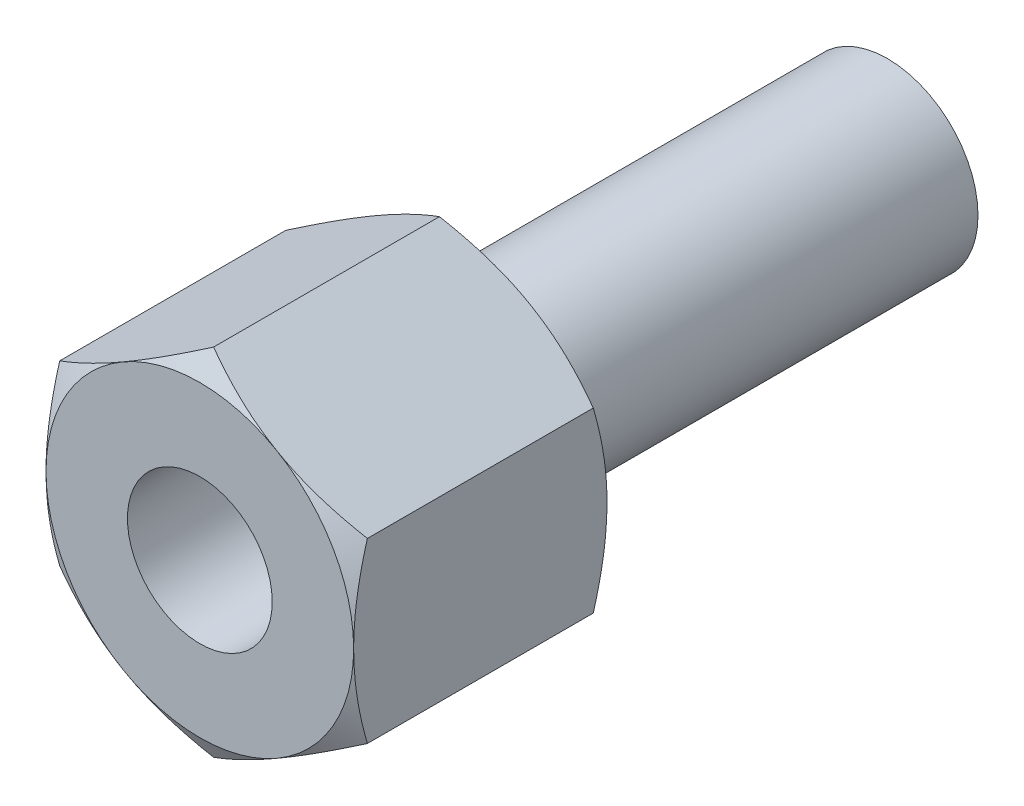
ISO-10303-21;
HEADER;
FILE_DESCRIPTION(('STEP AP214'),'2;1');
FILE_NAME('part.step','',(''),(''),'','','');
FILE_SCHEMA(('AUTOMOTIVE_DESIGN { 1 0 10303 214 1 1 1 1 }'));
ENDSEC;
DATA;
#1=APPLICATION_CONTEXT('core data for automotive mechanical design processes');
#2=APPLICATION_PROTOCOL_DEFINITION('international standard','automotive_design',2000,#1);
#3=PRODUCT_CONTEXT('',#1,'mechanical');
#4=PRODUCT('Part','Part','',(#3));
#5=PRODUCT_RELATED_PRODUCT_CATEGORY('part','',(#4));
#6=PRODUCT_DEFINITION_FORMATION('','',#4);
#7=PRODUCT_DEFINITION_CONTEXT('part definition',#1,'design');
#8=PRODUCT_DEFINITION('design','',#6,#7);
#9=PRODUCT_DEFINITION_SHAPE('','',#8);
#10=(LENGTH_UNIT() NAMED_UNIT(*) SI_UNIT(.MILLI.,.METRE.));
#11=(NAMED_UNIT(*) PLANE_ANGLE_UNIT() SI_UNIT($,.RADIAN.));
#12=(NAMED_UNIT(*) SI_UNIT($,.STERADIAN.) SOLID_ANGLE_UNIT());
#13=UNCERTAINTY_MEASURE_WITH_UNIT(LENGTH_MEASURE(1.E-05),#10,'distance_accuracy_value','');
#14=(GEOMETRIC_REPRESENTATION_CONTEXT(3) GLOBAL_UNCERTAINTY_ASSIGNED_CONTEXT((#13)) GLOBAL_UNIT_ASSIGNED_CONTEXT((#10,
#11,#12)) REPRESENTATION_CONTEXT('',''));
#15=CARTESIAN_POINT('',(0.,0.,0.));
#16=DIRECTION('',(0.,0.,1.));
#17=DIRECTION('',(1.,0.,0.));
#18=AXIS2_PLACEMENT_3D('',#15,#16,#17);
#19=CARTESIAN_POINT('',(-8.5,14.7224318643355,14.));
#20=DIRECTION('',(0.,0.,1.));
#21=DIRECTION('',(1.,0.,0.));
#22=AXIS2_PLACEMENT_3D('',#19,#20,#21);
#23=PLANE('',#22);
#24=CARTESIAN_POINT('',(0.,0.,14.));
#25=DIRECTION('',(0.,0.,1.));
#26=DIRECTION('',(1.,0.,0.));
#27=AXIS2_PLACEMENT_3D('',#24,#25,#26);
#28=CIRCLE('',#27,8.5);
#29=CARTESIAN_POINT('',(8.5,0.,14.));
#30=VERTEX_POINT('',#29);
#31=CARTESIAN_POINT('',(4.25,-7.36121593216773,14.));
#32=VERTEX_POINT('',#31);
#33=EDGE_CURVE('E311',#30,#32,#28,.F.);
#34=ORIENTED_EDGE('',*,*,#33,.F.);
#35=CARTESIAN_POINT('',(4.25,7.36121593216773,14.));
#36=VERTEX_POINT('',#35);
#37=EDGE_CURVE('E308',#36,#30,#28,.F.);
#38=ORIENTED_EDGE('',*,*,#37,.F.);
#39=CARTESIAN_POINT('',(-4.25,7.36121593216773,14.));
#40=VERTEX_POINT('',#39);
#41=EDGE_CURVE('E310',#40,#36,#28,.F.);
#42=ORIENTED_EDGE('',*,*,#41,.F.);
#43=CARTESIAN_POINT('',(0.,0.,14.));
#44=DIRECTION('',(0.,0.,-1.));
#45=DIRECTION('',(-1.,0.,0.));
#46=AXIS2_PLACEMENT_3D('',#43,#44,#45);
#47=CIRCLE('',#46,8.5);
#48=CARTESIAN_POINT('',(-8.5,0.,14.));
#49=VERTEX_POINT('',#48);
#50=EDGE_CURVE('E331',#49,#40,#47,.T.);
#51=ORIENTED_EDGE('',*,*,#50,.F.);
#52=CARTESIAN_POINT('',(-4.25,-7.36121593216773,14.));
#53=VERTEX_POINT('',#52);
#54=EDGE_CURVE('E314',#53,#49,#28,.F.);
#55=ORIENTED_EDGE('',*,*,#54,.F.);
#56=EDGE_CURVE('E316',#32,#53,#28,.F.);
#57=ORIENTED_EDGE('',*,*,#56,.F.);
#58=EDGE_LOOP('',(#34,#38,#42,#51,#55,#57));
#59=FACE_BOUND('',#58,.T.);
#60=CARTESIAN_POINT('',(0.,0.,14.));
#61=DIRECTION('',(0.,0.,1.));
#62=DIRECTION('',(1.,0.,0.));
#63=AXIS2_PLACEMENT_3D('',#60,#61,#62);
#64=CIRCLE('',#63,4.);
#65=CARTESIAN_POINT('',(4.,0.,14.));
#66=VERTEX_POINT('',#65);
#67=EDGE_CURVE('E287',#66,#66,#64,.T.);
#68=ORIENTED_EDGE('',*,*,#67,.F.);
#69=EDGE_LOOP('',(#68));
#70=FACE_BOUND('',#69,.T.);
#71=ADVANCED_FACE('F14',(#59,#70),#23,.T.);
#72=CARTESIAN_POINT('',(3.4,0.,6.));
#73=DIRECTION('',(0.,0.,-1.));
#74=DIRECTION('',(-1.,0.,0.));
#75=AXIS2_PLACEMENT_3D('',#72,#73,#74);
#76=PLANE('',#75);
#77=CARTESIAN_POINT('',(0.,0.,6.));
#78=DIRECTION('',(0.,0.,1.));
#79=DIRECTION('',(1.,0.,0.));
#80=AXIS2_PLACEMENT_3D('',#77,#78,#79);
#81=CIRCLE('',#80,4.);
#82=CARTESIAN_POINT('',(4.,0.,6.));
#83=VERTEX_POINT('',#82);
#84=EDGE_CURVE('E284',#83,#83,#81,.T.);
#85=ORIENTED_EDGE('',*,*,#84,.T.);
#86=EDGE_LOOP('',(#85));
#87=FACE_BOUND('',#86,.T.);
#88=ADVANCED_FACE('F250',(#87),#76,.F.);
#89=CARTESIAN_POINT('',(0.,0.,14.));
#90=DIRECTION('',(0.,0.,1.));
#91=DIRECTION('',(1.,0.,0.));
#92=AXIS2_PLACEMENT_3D('',#89,#90,#91);
#93=CYLINDRICAL_SURFACE('',#92,4.);
#94=ORIENTED_EDGE('',*,*,#84,.F.);
#95=EDGE_LOOP('',(#94));
#96=FACE_BOUND('',#95,.T.);
#97=ORIENTED_EDGE('',*,*,#67,.T.);
#98=EDGE_LOOP('',(#97));
#99=FACE_BOUND('',#98,.T.);
#100=ADVANCED_FACE('F256',(#96,#99),#93,.F.);
#101=CARTESIAN_POINT('',(0.,0.,14.));
#102=DIRECTION('',(0.,0.,-1.));
#103=DIRECTION('',(-1.,0.,0.));
#104=AXIS2_PLACEMENT_3D('',#101,#102,#103);
#105=CONICAL_SURFACE('',#104,8.5,1.0471975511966);
#106=ORIENTED_EDGE('',*,*,#37,.T.);
#107=CARTESIAN_POINT('',(8.5,-13.1838015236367,9.85093963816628));
#108=CARTESIAN_POINT('',(8.5,-12.8125439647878,10.0310397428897));
#109=CARTESIAN_POINT('',(8.5,-12.4404343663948,10.2094135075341));
#110=CARTESIAN_POINT('',(8.5,-11.6940579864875,10.5617374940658));
#111=CARTESIAN_POINT('',(8.5,-11.3197908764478,10.7356870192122));
#112=CARTESIAN_POINT('',(8.5,-10.5667187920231,11.0790664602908));
#113=CARTESIAN_POINT('',(8.5,-10.1879002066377,11.2484666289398));
#114=CARTESIAN_POINT('',(8.5,-9.42725080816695,11.5803371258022));
#115=CARTESIAN_POINT('',(8.5,-9.04542013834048,11.7428077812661));
#116=CARTESIAN_POINT('',(8.5,-8.26579118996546,12.0640781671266));
#117=CARTESIAN_POINT('',(8.5,-7.86787433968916,12.222591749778));
#118=CARTESIAN_POINT('',(8.5,-7.06738682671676,12.5276262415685));
#119=CARTESIAN_POINT('',(8.5,-6.66481564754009,12.6741458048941));
#120=CARTESIAN_POINT('',(8.5,-5.85512714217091,12.9513465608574));
#121=CARTESIAN_POINT('',(8.5,-5.44802090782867,13.0820598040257));
#122=CARTESIAN_POINT('',(8.5,-4.62798318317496,13.3234563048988));
#123=CARTESIAN_POINT('',(8.5,-4.21505357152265,13.43414586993));
#124=CARTESIAN_POINT('',(8.5,-3.38536736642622,13.6295856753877));
#125=CARTESIAN_POINT('',(8.5,-2.96864496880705,13.7144771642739));
#126=CARTESIAN_POINT('',(8.5,-2.33976505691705,13.8187936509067));
#127=CARTESIAN_POINT('',(8.5,-2.12949022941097,13.8497304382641));
#128=CARTESIAN_POINT('',(8.5,-1.70789480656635,13.903323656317));
#129=CARTESIAN_POINT('',(8.5,-1.4965743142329,13.9259808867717));
#130=CARTESIAN_POINT('',(8.5,-1.07593171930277,13.9622793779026));
#131=CARTESIAN_POINT('',(8.5,-0.866619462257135,13.9760342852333));
#132=CARTESIAN_POINT('',(8.5,-0.447600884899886,13.9946804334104));
#133=CARTESIAN_POINT('',(8.5,-0.237894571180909,13.9995718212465));
#134=CARTESIAN_POINT('',(8.5,0.181537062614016,14.000374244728));
#135=CARTESIAN_POINT('',(8.5,0.391262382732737,13.9962852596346));
#136=CARTESIAN_POINT('',(8.5,0.810354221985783,13.9792268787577));
#137=CARTESIAN_POINT('',(8.5,1.0197207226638,13.9662570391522));
#138=CARTESIAN_POINT('',(8.5,1.52285135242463,13.9246924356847));
#139=CARTESIAN_POINT('',(8.5,1.8162749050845,13.8918862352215));
#140=CARTESIAN_POINT('',(8.5,2.40093145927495,13.8106200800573));
#141=CARTESIAN_POINT('',(8.5,2.69216415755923,13.7621579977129));
#142=CARTESIAN_POINT('',(8.5,3.56225119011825,13.5958587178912));
#143=CARTESIAN_POINT('',(8.5,4.13716638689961,13.4571391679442));
#144=CARTESIAN_POINT('',(8.5,4.99679192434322,13.2167488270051));
#145=CARTESIAN_POINT('',(8.5,5.28596559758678,13.1301219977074));
#146=CARTESIAN_POINT('',(8.5,5.86150418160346,12.947909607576));
#147=CARTESIAN_POINT('',(8.5,6.14786907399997,12.8523239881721));
#148=CARTESIAN_POINT('',(8.5,6.7178806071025,12.6537243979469));
#149=CARTESIAN_POINT('',(8.5,7.00152811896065,12.5507129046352));
#150=CARTESIAN_POINT('',(8.5,7.56647596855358,12.3384697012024));
#151=CARTESIAN_POINT('',(8.5,7.84777633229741,12.2292380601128));
#152=CARTESIAN_POINT('',(8.5,8.50541058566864,11.9668356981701));
#153=CARTESIAN_POINT('',(8.5,8.8809007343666,11.8115544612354));
#154=CARTESIAN_POINT('',(8.5,9.62872987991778,11.493559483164));
#155=CARTESIAN_POINT('',(8.5,10.0010686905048,11.3308453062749));
#156=CARTESIAN_POINT('',(8.5,10.7431731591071,10.9994548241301));
#157=CARTESIAN_POINT('',(8.5,11.112938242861,10.8307772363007));
#158=CARTESIAN_POINT('',(8.5,11.8502384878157,10.4886477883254));
#159=CARTESIAN_POINT('',(8.5,12.2177736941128,10.3151960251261));
#160=CARTESIAN_POINT('',(8.5,12.951370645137,9.96421534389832));
#161=CARTESIAN_POINT('',(8.5,13.3174304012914,9.7866822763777));
#162=CARTESIAN_POINT('',(8.5,14.047975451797,9.42840278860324));
#163=CARTESIAN_POINT('',(8.5,14.4124607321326,9.24765633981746));
#164=CARTESIAN_POINT('',(8.5,15.5038325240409,8.7014894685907));
#165=CARTESIAN_POINT('',(8.5,16.2287303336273,8.33209552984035));
#166=CARTESIAN_POINT('',(8.5,17.6149585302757,7.61664110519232));
#167=CARTESIAN_POINT('',(8.5,18.2765956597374,7.27117230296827));
#168=CARTESIAN_POINT('',(8.5,19.5973912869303,6.5754775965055));
#169=CARTESIAN_POINT('',(8.49999999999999,20.2565496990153,6.22525152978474));
#170=CARTESIAN_POINT('',(8.49999999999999,21.5713156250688,5.52203266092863));
#171=CARTESIAN_POINT('',(8.49999999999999,22.2269278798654,5.16904870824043));
#172=CARTESIAN_POINT('',(8.49999999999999,23.5365636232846,4.46022892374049));
#173=CARTESIAN_POINT('',(8.5,24.1905871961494,4.1043932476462));
#174=CARTESIAN_POINT('',(8.5,24.8440243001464,3.74749110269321));
#175=B_SPLINE_CURVE_WITH_KNOTS('',3,(#107,#108,#109,#110,#111,#112,#113,#114,#115,#116,#117,
#118,#119,#120,#121,#122,#123,#124,#125,#126,#127,#128,#129,#130,#131,#132,#133,#134,#135,#136,
#137,#138,#139,#140,#141,#142,#143,#144,#145,#146,#147,#148,#149,#150,#151,#152,#153,#154,#155,
#156,#157,#158,#159,#160,#161,#162,#163,#164,#165,#166,#167,#168,#169,#170,#171,#172,#173,#174),
.UNSPECIFIED.,.F.,.F.,(4,2,2,2,2,2,2,2,2,2,2,2,2,2,2,2,2,2,2,2,2,2,2,2,2,2,2,2,2,2,2,2,2,4),(0.,
1.23792220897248,2.47603817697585,3.72089197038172,4.96568690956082,6.25051912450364,
7.53549530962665,8.81782062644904,10.0997413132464,11.3745112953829,12.0119892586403,
12.649405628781,13.2785153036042,13.9076145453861,14.536715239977,15.1658473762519,
16.0511025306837,16.9364780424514,18.708213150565,19.6137486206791,20.5192900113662,
21.424530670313,22.3297612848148,23.5486479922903,24.7676062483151,25.9868282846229,
27.2060255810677,28.4265226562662,29.6470305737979,32.087728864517,34.3269070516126,
36.5661619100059,38.7999462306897,41.0336093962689),.UNSPECIFIED.);
#176=CARTESIAN_POINT('',(8.5,4.90747728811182,13.2408106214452));
#177=VERTEX_POINT('',#176);
#178=EDGE_CURVE('E343',#177,#30,#175,.F.);
#179=ORIENTED_EDGE('',*,*,#178,.F.);
#180=CARTESIAN_POINT('',(-0.000200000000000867,9.81507004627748,13.240743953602));
#181=CARTESIAN_POINT('',(0.18663922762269,9.70719836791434,13.3030138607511));
#182=CARTESIAN_POINT('',(0.374175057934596,9.59892450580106,13.3624577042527));
#183=CARTESIAN_POINT('',(0.750769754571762,9.3814974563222,13.4749148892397));
#184=CARTESIAN_POINT('',(0.939829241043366,9.27234391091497,13.5279254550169));
#185=CARTESIAN_POINT('',(1.5100347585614,8.94313560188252,13.6762666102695));
#186=CARTESIAN_POINT('',(1.89343164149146,8.72178130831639,13.7606410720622));
#187=CARTESIAN_POINT('',(2.46717766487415,8.39052888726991,13.8595799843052));
#188=CARTESIAN_POINT('',(2.65581276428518,8.28162036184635,13.8877648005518));
#189=CARTESIAN_POINT('',(3.0339360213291,8.06331079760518,13.9350259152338));
#190=CARTESIAN_POINT('',(3.22342410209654,7.95390980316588,13.954103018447));
#191=CARTESIAN_POINT('',(3.60272652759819,7.73491944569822,13.9826652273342));
#192=CARTESIAN_POINT('',(3.79254025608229,7.62533043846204,13.9921612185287));
#193=CARTESIAN_POINT('',(4.17234305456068,7.40605119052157,14.0013576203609));
#194=CARTESIAN_POINT('',(4.36233211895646,7.29636095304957,14.0010583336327));
#195=CARTESIAN_POINT('',(4.71752301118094,7.09129139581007,13.9913455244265));
#196=CARTESIAN_POINT('',(4.88274990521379,6.99589760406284,13.9831168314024));
#197=CARTESIAN_POINT('',(5.21281671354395,6.80533344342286,13.9594107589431));
#198=CARTESIAN_POINT('',(5.37765660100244,6.71016309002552,13.9439328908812));
#199=CARTESIAN_POINT('',(5.87153810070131,6.42502047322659,13.8869913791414));
#200=CARTESIAN_POINT('',(6.19970550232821,6.23555293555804,13.8350269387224));
#201=CARTESIAN_POINT('',(6.85952142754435,5.8546080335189,13.7051150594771));
#202=CARTESIAN_POINT('',(7.19108574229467,5.66317928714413,13.626616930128));
#203=CARTESIAN_POINT('',(7.84926989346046,5.28317649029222,13.4484586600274));
#204=CARTESIAN_POINT('',(8.17589815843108,5.09459757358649,13.34884036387));
#205=CARTESIAN_POINT('',(8.5002,4.90736181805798,13.240743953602));
#206=B_SPLINE_CURVE_WITH_KNOTS('',3,(#180,#181,#182,#183,#184,#185,#186,#187,#188,#189,#190,
#191,#192,#193,#194,#195,#196,#197,#198,#199,#200,#201,#202,#203,#204,#205),.UNSPECIFIED.,.F.,
.F.,(4,2,2,2,2,2,2,2,2,2,2,2,4),(0.,0.673596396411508,1.34748239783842,2.69805431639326,
3.35679995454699,4.01548737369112,4.67342558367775,5.33134346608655,5.90409556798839,
6.47688628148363,7.62328361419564,8.79510569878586,9.9646274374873),.UNSPECIFIED.);
#207=EDGE_CURVE('E345',#36,#177,#206,.T.);
#208=ORIENTED_EDGE('',*,*,#207,.F.);
#209=EDGE_LOOP('',(#106,#179,#208));
#210=FACE_BOUND('',#209,.T.);
#211=ADVANCED_FACE('F273',(#210),#105,.T.);
#212=CARTESIAN_POINT('',(-8.5002,4.90736181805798,13.240743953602));
#213=CARTESIAN_POINT('',(-8.31336077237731,5.01523349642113,13.3030138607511));
#214=CARTESIAN_POINT('',(-8.1258249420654,5.12350735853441,13.3624577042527));
#215=CARTESIAN_POINT('',(-7.74923024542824,5.34093440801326,13.4749148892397));
#216=CARTESIAN_POINT('',(-7.56017075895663,5.45008795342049,13.5279254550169));
#217=CARTESIAN_POINT('',(-6.9899652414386,5.77929626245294,13.6762666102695));
#218=CARTESIAN_POINT('',(-6.60656835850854,6.00065055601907,13.7606410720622));
#219=CARTESIAN_POINT('',(-6.03282233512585,6.33190297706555,13.8595799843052));
#220=CARTESIAN_POINT('',(-5.84418723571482,6.44081150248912,13.8877648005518));
#221=CARTESIAN_POINT('',(-5.4660639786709,6.65912106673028,13.9350259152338));
#222=CARTESIAN_POINT('',(-5.27657589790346,6.76852206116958,13.954103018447));
#223=CARTESIAN_POINT('',(-4.8972734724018,6.98751241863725,13.9826652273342));
#224=CARTESIAN_POINT('',(-4.70745974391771,7.09710142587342,13.9921612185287));
#225=CARTESIAN_POINT('',(-4.32765694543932,7.3163806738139,14.0013576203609));
#226=CARTESIAN_POINT('',(-4.13766788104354,7.42607091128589,14.0010583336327));
#227=CARTESIAN_POINT('',(-3.78247698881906,7.63114046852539,13.9913455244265));
#228=CARTESIAN_POINT('',(-3.6172500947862,7.72653426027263,13.9831168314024));
#229=CARTESIAN_POINT('',(-3.28718328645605,7.9170984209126,13.9594107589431));
#230=CARTESIAN_POINT('',(-3.12234339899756,8.01226877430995,13.9439328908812));
#231=CARTESIAN_POINT('',(-2.62846189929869,8.29741139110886,13.8869913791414));
#232=CARTESIAN_POINT('',(-2.30029449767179,8.48687892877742,13.8350269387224));
#233=CARTESIAN_POINT('',(-1.64047857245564,8.86782383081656,13.7051150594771));
#234=CARTESIAN_POINT('',(-1.30891425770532,9.05925257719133,13.626616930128));
#235=CARTESIAN_POINT('',(-0.650730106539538,9.43925537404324,13.4484586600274));
#236=CARTESIAN_POINT('',(-0.324101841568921,9.62783429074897,13.34884036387));
#237=CARTESIAN_POINT('',(0.00020000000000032,9.81507004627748,13.240743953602));
#238=B_SPLINE_CURVE_WITH_KNOTS('',3,(#212,#213,#214,#215,#216,#217,#218,#219,#220,#221,#222,
#223,#224,#225,#226,#227,#228,#229,#230,#231,#232,#233,#234,#235,#236,#237),.UNSPECIFIED.,.F.,
.F.,(4,2,2,2,2,2,2,2,2,2,2,2,4),(0.,0.673596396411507,1.34748239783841,2.69805431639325,
3.35679995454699,4.01548737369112,4.67342558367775,5.33134346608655,5.90409556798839,
6.47688628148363,7.62328361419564,8.79510569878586,9.9646274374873),.UNSPECIFIED.);
#239=CARTESIAN_POINT('',(0.,9.81495457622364,13.2408106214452));
#240=VERTEX_POINT('',#239);
#241=EDGE_CURVE('E209',#40,#240,#238,.T.);
#242=ORIENTED_EDGE('',*,*,#241,.F.);
#243=ORIENTED_EDGE('',*,*,#41,.T.);
#244=EDGE_CURVE('E348',#240,#36,#206,.T.);
#245=ORIENTED_EDGE('',*,*,#244,.F.);
#246=EDGE_LOOP('',(#242,#243,#245));
#247=FACE_BOUND('',#246,.T.);
#248=ADVANCED_FACE('F167',(#247),#105,.T.);
#249=ORIENTED_EDGE('',*,*,#50,.T.);
#250=CARTESIAN_POINT('',(-8.5,4.90747728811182,13.2408106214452));
#251=VERTEX_POINT('',#250);
#252=EDGE_CURVE('E208',#251,#40,#238,.T.);
#253=ORIENTED_EDGE('',*,*,#252,.F.);
#254=CARTESIAN_POINT('',(-8.5,-13.1838015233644,9.85093963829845));
#255=CARTESIAN_POINT('',(-8.5,-12.8125439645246,10.0310397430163));
#256=CARTESIAN_POINT('',(-8.5,-12.4404343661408,10.2094135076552));
#257=CARTESIAN_POINT('',(-8.5,-11.6940579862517,10.5617374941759));
#258=CARTESIAN_POINT('',(-8.5,-11.3197908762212,10.7356870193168));
#259=CARTESIAN_POINT('',(-8.5,-10.5667187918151,11.0790664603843));
#260=CARTESIAN_POINT('',(-8.5,-10.187900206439,11.2484666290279));
#261=CARTESIAN_POINT('',(-8.5,-9.42725080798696,11.5803371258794));
#262=CARTESIAN_POINT('',(-8.5,-9.04542013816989,11.7428077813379));
#263=CARTESIAN_POINT('',(-8.5,-8.26579118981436,12.0640781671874));
#264=CARTESIAN_POINT('',(-8.5,-7.86787433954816,12.2225917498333));
#265=CARTESIAN_POINT('',(-8.5,-7.06738682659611,12.527626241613));
#266=CARTESIAN_POINT('',(-8.5,-6.66481564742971,12.6741458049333));
#267=CARTESIAN_POINT('',(-8.5,-5.85512714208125,12.9513465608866));
#268=CARTESIAN_POINT('',(-8.5,-5.44802090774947,13.0820598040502));
#269=CARTESIAN_POINT('',(-8.5,-4.62798318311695,13.3234563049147));
#270=CARTESIAN_POINT('',(-8.5,-4.21505357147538,13.4341458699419));
#271=CARTESIAN_POINT('',(-8.5,-3.38536736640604,13.6295856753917));
#272=CARTESIAN_POINT('',(-8.5,-2.9686449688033,13.7144771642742));
#273=CARTESIAN_POINT('',(-8.5,-2.33976505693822,13.8187936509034));
#274=CARTESIAN_POINT('',(-8.5,-2.12949022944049,13.8497304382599));
#275=CARTESIAN_POINT('',(-8.5,-1.70789480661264,13.9033236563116));
#276=CARTESIAN_POINT('',(-8.5,-1.4965743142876,13.9259808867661));
#277=CARTESIAN_POINT('',(-8.5,-1.07593171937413,13.9622793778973));
#278=CARTESIAN_POINT('',(-8.5,-0.86661946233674,13.9760342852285));
#279=CARTESIAN_POINT('',(-8.5,-0.447600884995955,13.9946804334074));
#280=CARTESIAN_POINT('',(-8.5,-0.2378945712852,13.9995718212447));
#281=CARTESIAN_POINT('',(-8.5,0.181537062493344,14.0003742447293));
#282=CARTESIAN_POINT('',(-8.5,0.391262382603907,13.9962852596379));
#283=CARTESIAN_POINT('',(-8.5,0.810354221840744,13.9792268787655));
#284=CARTESIAN_POINT('',(-8.5,1.01972072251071,13.9662570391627));
#285=CARTESIAN_POINT('',(-8.5,1.52285135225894,13.9246924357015));
#286=CARTESIAN_POINT('',(-8.5,1.81627490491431,13.891886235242));
#287=CARTESIAN_POINT('',(-8.5,2.40093145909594,13.8106200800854));
#288=CARTESIAN_POINT('',(-8.5,2.69216415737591,13.7621579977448));
#289=CARTESIAN_POINT('',(-8.5,3.56225118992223,13.5958587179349));
#290=CARTESIAN_POINT('',(-8.5,4.13716638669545,13.4571391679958));
#291=CARTESIAN_POINT('',(-8.5,4.99679192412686,13.2167488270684));
#292=CARTESIAN_POINT('',(-8.5,5.28596559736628,13.1301219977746));
#293=CARTESIAN_POINT('',(-8.5,5.86150418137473,12.947909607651));
#294=CARTESIAN_POINT('',(-8.5,6.14786907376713,12.8523239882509));
#295=CARTESIAN_POINT('',(-8.5,6.7178806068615,12.6537243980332));
#296=CARTESIAN_POINT('',(-8.5,7.00152811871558,12.5507129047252));
#297=CARTESIAN_POINT('',(-8.5,7.56647596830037,12.3384697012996));
#298=CARTESIAN_POINT('',(-8.5,7.84777633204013,12.2292380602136));
#299=CARTESIAN_POINT('',(-8.5,8.50541058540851,11.9668356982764));
#300=CARTESIAN_POINT('',(-8.5,8.88090073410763,11.8115544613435));
#301=CARTESIAN_POINT('',(-8.5,9.62872987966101,11.4935594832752));
#302=CARTESIAN_POINT('',(-8.5,10.0010686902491,11.3308453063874));
#303=CARTESIAN_POINT('',(-8.5,10.7431731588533,10.9994548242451));
#304=CARTESIAN_POINT('',(-8.5,11.1129382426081,10.8307772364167));
#305=CARTESIAN_POINT('',(-8.5,11.8502384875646,10.4886477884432));
#306=CARTESIAN_POINT('',(-8.5,12.2177736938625,10.3151960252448));
#307=CARTESIAN_POINT('',(-8.5,12.9513706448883,9.96421534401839));
#308=CARTESIAN_POINT('',(-8.5,13.3174304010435,9.78668227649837));
#309=CARTESIAN_POINT('',(-8.5,14.0479754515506,9.42840278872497));
#310=CARTESIAN_POINT('',(-8.5,14.4124607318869,9.24765633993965));
#311=CARTESIAN_POINT('',(-8.5,15.5038325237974,8.70148946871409));
#312=CARTESIAN_POINT('',(-8.5,16.228730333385,8.33209552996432));
#313=CARTESIAN_POINT('',(-8.5,17.6149585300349,7.61664110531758));
#314=CARTESIAN_POINT('',(-8.5,18.2765956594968,7.27117230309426));
#315=CARTESIAN_POINT('',(-8.5,19.59739128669,6.57547759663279));
#316=CARTESIAN_POINT('',(-8.5,20.2565496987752,6.22525152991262));
#317=CARTESIAN_POINT('',(-8.5,21.5713156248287,5.52203266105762));
#318=CARTESIAN_POINT('',(-8.5,22.2269278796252,5.16904870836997));
#319=CARTESIAN_POINT('',(-8.5,23.5365636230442,4.46022892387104));
#320=CARTESIAN_POINT('',(-8.5,24.1905871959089,4.10439324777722));
#321=CARTESIAN_POINT('',(-8.5,24.8440242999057,3.74749110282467));
#322=B_SPLINE_CURVE_WITH_KNOTS('',3,(#254,#255,#256,#257,#258,#259,#260,#261,#262,#263,#264,
#265,#266,#267,#268,#269,#270,#271,#272,#273,#274,#275,#276,#277,#278,#279,#280,#281,#282,#283,
#284,#285,#286,#287,#288,#289,#290,#291,#292,#293,#294,#295,#296,#297,#298,#299,#300,#301,#302,
#303,#304,#305,#306,#307,#308,#309,#310,#311,#312,#313,#314,#315,#316,#317,#318,#319,#320,#321),
.UNSPECIFIED.,.F.,.F.,(4,2,2,2,2,2,2,2,2,2,2,2,2,2,2,2,2,2,2,2,2,2,2,2,2,2,2,2,2,2,2,2,2,4),(0.,
1.23792220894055,2.47603817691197,3.72089197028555,4.96568690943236,6.25051912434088,
7.5354953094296,8.8178206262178,10.099741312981,11.3745112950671,12.0119892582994,
12.6494056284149,13.2785153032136,13.9076145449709,14.5367152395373,15.1658473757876,
16.0511025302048,16.9364780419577,18.708213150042,19.6137486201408,20.5192900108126,
21.4245306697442,22.3297612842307,23.5486479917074,24.7676062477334,25.9868282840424,
27.2060255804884,28.4265226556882,29.6470305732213,32.087728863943,34.3269070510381,
36.566161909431,38.7999462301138,41.0336093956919),.UNSPECIFIED.);
#323=EDGE_CURVE('E200',#49,#251,#322,.T.);
#324=ORIENTED_EDGE('',*,*,#323,.F.);
#325=EDGE_LOOP('',(#249,#253,#324));
#326=FACE_BOUND('',#325,.T.);
#327=ADVANCED_FACE('F363',(#326),#105,.T.);
#328=ORIENTED_EDGE('',*,*,#54,.T.);
#329=CARTESIAN_POINT('',(-8.5,-4.90747728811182,13.2408106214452));
#330=VERTEX_POINT('',#329);
#331=EDGE_CURVE('E207',#330,#49,#322,.T.);
#332=ORIENTED_EDGE('',*,*,#331,.F.);
#333=CARTESIAN_POINT('',(0.000199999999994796,-9.81507004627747,13.240743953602));
#334=CARTESIAN_POINT('',(-0.186639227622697,-9.70719836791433,13.3030138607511));
#335=CARTESIAN_POINT('',(-0.374175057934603,-9.59892450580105,13.3624577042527));
#336=CARTESIAN_POINT('',(-0.75076975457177,-9.3814974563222,13.4749148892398));
#337=CARTESIAN_POINT('',(-0.939829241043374,-9.27234391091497,13.5279254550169));
#338=CARTESIAN_POINT('',(-1.5100347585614,-8.94313560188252,13.6762666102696));
#339=CARTESIAN_POINT('',(-1.89343164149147,-8.72178130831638,13.7606410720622));
#340=CARTESIAN_POINT('',(-2.46717766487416,-8.39052888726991,13.8595799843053));
#341=CARTESIAN_POINT('',(-2.65581276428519,-8.28162036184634,13.8877648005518));
#342=CARTESIAN_POINT('',(-3.03393602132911,-8.06331079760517,13.9350259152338));
#343=CARTESIAN_POINT('',(-3.22342410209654,-7.95390980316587,13.954103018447));
#344=CARTESIAN_POINT('',(-3.6027265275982,-7.73491944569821,13.9826652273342));
#345=CARTESIAN_POINT('',(-3.79254025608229,-7.62533043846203,13.9921612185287));
#346=CARTESIAN_POINT('',(-4.17234305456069,-7.40605119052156,14.0013576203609));
#347=CARTESIAN_POINT('',(-4.36233211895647,-7.29636095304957,14.0010583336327));
#348=CARTESIAN_POINT('',(-4.71752301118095,-7.09129139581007,13.9913455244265));
#349=CARTESIAN_POINT('',(-4.8827499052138,-6.99589760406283,13.9831168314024));
#350=CARTESIAN_POINT('',(-5.21281671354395,-6.80533344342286,13.9594107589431));
#351=CARTESIAN_POINT('',(-5.37765660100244,-6.71016309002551,13.9439328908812));
#352=CARTESIAN_POINT('',(-5.87153810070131,-6.42502047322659,13.8869913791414));
#353=CARTESIAN_POINT('',(-6.19970550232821,-6.23555293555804,13.8350269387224));
#354=CARTESIAN_POINT('',(-6.85952142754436,-5.8546080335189,13.7051150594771));
#355=CARTESIAN_POINT('',(-7.19108574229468,-5.66317928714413,13.626616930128));
#356=CARTESIAN_POINT('',(-7.84926989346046,-5.28317649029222,13.4484586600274));
#357=CARTESIAN_POINT('',(-8.17589815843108,-5.09459757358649,13.34884036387));
#358=CARTESIAN_POINT('',(-8.5002,-4.90736181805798,13.240743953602));
#359=B_SPLINE_CURVE_WITH_KNOTS('',3,(#333,#334,#335,#336,#337,#338,#339,#340,#341,#342,#343,
#344,#345,#346,#347,#348,#349,#350,#351,#352,#353,#354,#355,#356,#357,#358),.UNSPECIFIED.,.F.,
.F.,(4,2,2,2,2,2,2,2,2,2,2,2,4),(0.,0.673596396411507,1.34748239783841,2.69805431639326,
3.35679995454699,4.01548737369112,4.67342558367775,5.33134346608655,5.90409556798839,
6.47688628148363,7.62328361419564,8.79510569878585,9.96462743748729),.UNSPECIFIED.);
#360=EDGE_CURVE('E214',#53,#330,#359,.T.);
#361=ORIENTED_EDGE('',*,*,#360,.F.);
#362=EDGE_LOOP('',(#328,#332,#361));
#363=FACE_BOUND('',#362,.T.);
#364=ADVANCED_FACE('F326',(#363),#105,.T.);
#365=ORIENTED_EDGE('',*,*,#56,.T.);
#366=CARTESIAN_POINT('',(0.,-9.81495457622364,13.2408106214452));
#367=VERTEX_POINT('',#366);
#368=EDGE_CURVE('E221',#367,#53,#359,.T.);
#369=ORIENTED_EDGE('',*,*,#368,.F.);
#370=CARTESIAN_POINT('',(8.5002,-4.90736181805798,13.240743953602));
#371=CARTESIAN_POINT('',(8.31336077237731,-5.01523349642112,13.3030138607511));
#372=CARTESIAN_POINT('',(8.1258249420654,-5.1235073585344,13.3624577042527));
#373=CARTESIAN_POINT('',(7.74923024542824,-5.34093440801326,13.4749148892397));
#374=CARTESIAN_POINT('',(7.56017075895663,-5.45008795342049,13.5279254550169));
#375=CARTESIAN_POINT('',(6.9899652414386,-5.77929626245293,13.6762666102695));
#376=CARTESIAN_POINT('',(6.60656835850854,-6.00065055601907,13.7606410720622));
#377=CARTESIAN_POINT('',(6.03282233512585,-6.33190297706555,13.8595799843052));
#378=CARTESIAN_POINT('',(5.84418723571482,-6.44081150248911,13.8877648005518));
#379=CARTESIAN_POINT('',(5.4660639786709,-6.65912106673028,13.9350259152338));
#380=CARTESIAN_POINT('',(5.27657589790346,-6.76852206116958,13.954103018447));
#381=CARTESIAN_POINT('',(4.8972734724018,-6.98751241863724,13.9826652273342));
#382=CARTESIAN_POINT('',(4.70745974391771,-7.09710142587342,13.9921612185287));
#383=CARTESIAN_POINT('',(4.32765694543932,-7.31638067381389,14.0013576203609));
#384=CARTESIAN_POINT('',(4.13766788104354,-7.42607091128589,14.0010583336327));
#385=CARTESIAN_POINT('',(3.78247698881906,-7.63114046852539,13.9913455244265));
#386=CARTESIAN_POINT('',(3.61725009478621,-7.72653426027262,13.9831168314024));
#387=CARTESIAN_POINT('',(3.28718328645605,-7.9170984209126,13.9594107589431));
#388=CARTESIAN_POINT('',(3.12234339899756,-8.01226877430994,13.9439328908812));
#389=CARTESIAN_POINT('',(2.62846189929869,-8.29741139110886,13.8869913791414));
#390=CARTESIAN_POINT('',(2.30029449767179,-8.48687892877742,13.8350269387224));
#391=CARTESIAN_POINT('',(1.64047857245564,-8.86782383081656,13.7051150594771));
#392=CARTESIAN_POINT('',(1.30891425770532,-9.05925257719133,13.626616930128));
#393=CARTESIAN_POINT('',(0.650730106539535,-9.43925537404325,13.4484586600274));
#394=CARTESIAN_POINT('',(0.324101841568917,-9.62783429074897,13.34884036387));
#395=CARTESIAN_POINT('',(-0.000200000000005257,-9.81507004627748,13.240743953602));
#396=B_SPLINE_CURVE_WITH_KNOTS('',3,(#370,#371,#372,#373,#374,#375,#376,#377,#378,#379,#380,
#381,#382,#383,#384,#385,#386,#387,#388,#389,#390,#391,#392,#393,#394,#395),.UNSPECIFIED.,.F.,
.F.,(4,2,2,2,2,2,2,2,2,2,2,2,4),(0.,0.673596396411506,1.34748239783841,2.69805431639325,
3.35679995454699,4.01548737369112,4.67342558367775,5.33134346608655,5.90409556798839,
6.47688628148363,7.62328361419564,8.79510569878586,9.9646274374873),.UNSPECIFIED.);
#397=EDGE_CURVE('E222',#32,#367,#396,.T.);
#398=ORIENTED_EDGE('',*,*,#397,.F.);
#399=EDGE_LOOP('',(#365,#369,#398));
#400=FACE_BOUND('',#399,.T.);
#401=ADVANCED_FACE('F337',(#400),#105,.T.);
#402=ORIENTED_EDGE('',*,*,#33,.T.);
#403=CARTESIAN_POINT('',(8.5,-4.90747728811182,13.2408106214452));
#404=VERTEX_POINT('',#403);
#405=EDGE_CURVE('E229',#404,#32,#396,.T.);
#406=ORIENTED_EDGE('',*,*,#405,.F.);
#407=EDGE_CURVE('E230',#30,#404,#175,.F.);
#408=ORIENTED_EDGE('',*,*,#407,.F.);
#409=EDGE_LOOP('',(#402,#406,#408));
#410=FACE_BOUND('',#409,.T.);
#411=ADVANCED_FACE('F280',(#410),#105,.T.);
#412=CARTESIAN_POINT('',(0.,9.81495457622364,14.));
#413=DIRECTION('',(0.5,-0.866025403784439,0.));
#414=DIRECTION('',(0.866025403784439,0.5,0.));
#415=AXIS2_PLACEMENT_3D('',#412,#413,#414);
#416=PLANE('',#415);
#417=DIRECTION('',(0.,0.,-1.));
#418=VECTOR('',#417,1.);
#419=CARTESIAN_POINT('',(0.,9.81495457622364,14.));
#420=LINE('',#419,#418);
#421=CARTESIAN_POINT('',(0.,9.81495457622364,0.75918937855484));
#422=VERTEX_POINT('',#421);
#423=EDGE_CURVE('E306',#240,#422,#420,.T.);
#424=ORIENTED_EDGE('',*,*,#423,.T.);
#425=CARTESIAN_POINT('',(0.000199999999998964,9.81507004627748,0.759256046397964));
#426=CARTESIAN_POINT('',(-0.18663922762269,9.70719836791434,0.696986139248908));
#427=CARTESIAN_POINT('',(-0.374175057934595,9.59892450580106,0.637542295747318));
#428=CARTESIAN_POINT('',(-0.750769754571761,9.3814974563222,0.525085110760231));
#429=CARTESIAN_POINT('',(-0.939829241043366,9.27234391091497,0.472074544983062));
#430=CARTESIAN_POINT('',(-1.5100347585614,8.94313560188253,0.323733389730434));
#431=CARTESIAN_POINT('',(-1.89343164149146,8.72178130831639,0.239358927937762));
#432=CARTESIAN_POINT('',(-2.46717766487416,8.39052888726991,0.140420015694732));
#433=CARTESIAN_POINT('',(-2.65581276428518,8.28162036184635,0.112235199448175));
#434=CARTESIAN_POINT('',(-3.03393602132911,8.06331079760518,0.0649740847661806));
#435=CARTESIAN_POINT('',(-3.22342410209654,7.95390980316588,0.0458969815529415));
#436=CARTESIAN_POINT('',(-3.6027265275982,7.73491944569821,0.0173347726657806));
#437=CARTESIAN_POINT('',(-3.79254025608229,7.62533043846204,0.00783878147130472));
#438=CARTESIAN_POINT('',(-4.17234305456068,7.40605119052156,-0.00135762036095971));
#439=CARTESIAN_POINT('',(-4.36233211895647,7.29636095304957,-0.00105833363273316));
#440=CARTESIAN_POINT('',(-4.71752301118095,7.09129139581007,0.00865447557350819));
#441=CARTESIAN_POINT('',(-4.8827499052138,6.99589760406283,0.0168831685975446));
#442=CARTESIAN_POINT('',(-5.21281671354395,6.80533344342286,0.0405892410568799));
#443=CARTESIAN_POINT('',(-5.37765660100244,6.71016309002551,0.056067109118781));
#444=CARTESIAN_POINT('',(-5.87153810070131,6.42502047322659,0.113008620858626));
#445=CARTESIAN_POINT('',(-6.19970550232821,6.23555293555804,0.164973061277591));
#446=CARTESIAN_POINT('',(-6.85952142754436,5.8546080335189,0.294884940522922));
#447=CARTESIAN_POINT('',(-7.19108574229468,5.66317928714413,0.373383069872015));
#448=CARTESIAN_POINT('',(-7.84926989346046,5.28317649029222,0.551541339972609));
#449=CARTESIAN_POINT('',(-8.17589815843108,5.0945975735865,0.651159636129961));
#450=CARTESIAN_POINT('',(-8.5002,4.90736181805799,0.759256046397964));
#451=B_SPLINE_CURVE_WITH_KNOTS('',3,(#425,#426,#427,#428,#429,#430,#431,#432,#433,#434,#435,
#436,#437,#438,#439,#440,#441,#442,#443,#444,#445,#446,#447,#448,#449,#450),.UNSPECIFIED.,.F.,
.F.,(4,2,2,2,2,2,2,2,2,2,2,2,4),(0.,0.673596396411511,1.34748239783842,2.69805431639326,
3.356799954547,4.01548737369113,4.67342558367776,5.33134346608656,5.9040955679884,
6.47688628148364,7.62328361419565,8.79510569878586,9.9646274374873),.UNSPECIFIED.);
#452=CARTESIAN_POINT('',(-4.25,7.36121593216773,0.));
#453=VERTEX_POINT('',#452);
#454=EDGE_CURVE('E334',#422,#453,#451,.T.);
#455=ORIENTED_EDGE('',*,*,#454,.T.);
#456=CARTESIAN_POINT('',(-8.5,4.90747728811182,0.759189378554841));
#457=VERTEX_POINT('',#456);
#458=EDGE_CURVE('E116',#453,#457,#451,.T.);
#459=ORIENTED_EDGE('',*,*,#458,.T.);
#460=DIRECTION('',(0.,0.,-1.));
#461=VECTOR('',#460,1.);
#462=CARTESIAN_POINT('',(-8.5,4.90747728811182,14.));
#463=LINE('',#462,#461);
#464=EDGE_CURVE('E138',#251,#457,#463,.T.);
#465=ORIENTED_EDGE('',*,*,#464,.F.);
#466=ORIENTED_EDGE('',*,*,#252,.T.);
#467=ORIENTED_EDGE('',*,*,#241,.T.);
#468=EDGE_LOOP('',(#424,#455,#459,#465,#466,#467));
#469=FACE_BOUND('',#468,.T.);
#470=ADVANCED_FACE('F195',(#469),#416,.F.);
#471=CARTESIAN_POINT('',(-8.5,4.90747728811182,14.));
#472=DIRECTION('',(1.,0.,0.));
#473=DIRECTION('',(0.,0.,-1.));
#474=AXIS2_PLACEMENT_3D('',#471,#472,#473);
#475=PLANE('',#474);
#476=ORIENTED_EDGE('',*,*,#464,.T.);
#477=CARTESIAN_POINT('',(-8.5,-13.1838015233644,4.14906036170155));
#478=CARTESIAN_POINT('',(-8.5,-12.8125439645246,3.96896025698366));
#479=CARTESIAN_POINT('',(-8.5,-12.4404343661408,3.79058649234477));
#480=CARTESIAN_POINT('',(-8.5,-11.6940579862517,3.43826250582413));
#481=CARTESIAN_POINT('',(-8.5,-11.3197908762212,3.26431298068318));
#482=CARTESIAN_POINT('',(-8.5,-10.5667187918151,2.92093353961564));
#483=CARTESIAN_POINT('',(-8.5,-10.187900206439,2.75153337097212));
#484=CARTESIAN_POINT('',(-8.5,-9.42725080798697,2.41966287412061));
#485=CARTESIAN_POINT('',(-8.5,-9.04542013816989,2.25719221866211));
#486=CARTESIAN_POINT('',(-8.5,-8.26579118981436,1.93592183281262));
#487=CARTESIAN_POINT('',(-8.5,-7.86787433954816,1.77740825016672));
#488=CARTESIAN_POINT('',(-8.5,-7.06738682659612,1.47237375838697));
#489=CARTESIAN_POINT('',(-8.5,-6.66481564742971,1.32585419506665));
#490=CARTESIAN_POINT('',(-8.5,-5.85512714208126,1.04865343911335));
#491=CARTESIAN_POINT('',(-8.5,-5.44802090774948,0.917940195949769));
#492=CARTESIAN_POINT('',(-8.5,-4.62798318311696,0.676543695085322));
#493=CARTESIAN_POINT('',(-8.5,-4.21505357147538,0.565854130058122));
#494=CARTESIAN_POINT('',(-8.5,-3.38536736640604,0.370414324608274));
#495=CARTESIAN_POINT('',(-8.5,-2.9686449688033,0.285522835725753));
#496=CARTESIAN_POINT('',(-8.5,-2.33976505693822,0.181206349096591));
#497=CARTESIAN_POINT('',(-8.5,-2.12949022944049,0.150269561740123));
#498=CARTESIAN_POINT('',(-8.5,-1.70789480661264,0.0966763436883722));
#499=CARTESIAN_POINT('',(-8.5,-1.4965743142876,0.0740191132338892));
#500=CARTESIAN_POINT('',(-8.5,-1.07593171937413,0.0377206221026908));
#501=CARTESIAN_POINT('',(-8.5,-0.86661946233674,0.0239657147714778));
#502=CARTESIAN_POINT('',(-8.5,-0.447600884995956,0.00531956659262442));
#503=CARTESIAN_POINT('',(-8.5,-0.237894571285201,0.000428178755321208));
#504=CARTESIAN_POINT('',(-8.5,0.181537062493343,-0.000374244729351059));
#505=CARTESIAN_POINT('',(-8.5,0.391262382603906,0.00371474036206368));
#506=CARTESIAN_POINT('',(-8.5,0.810354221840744,0.0207731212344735));
#507=CARTESIAN_POINT('',(-8.5,1.01972072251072,0.0337429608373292));
#508=CARTESIAN_POINT('',(-8.5,1.52285135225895,0.0753075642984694));
#509=CARTESIAN_POINT('',(-8.5,1.81627490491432,0.108113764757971));
#510=CARTESIAN_POINT('',(-8.5,2.40093145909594,0.189379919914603));
#511=CARTESIAN_POINT('',(-8.5,2.69216415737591,0.237842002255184));
#512=CARTESIAN_POINT('',(-8.5,3.56225118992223,0.404141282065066));
#513=CARTESIAN_POINT('',(-8.5,4.13716638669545,0.54286083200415));
#514=CARTESIAN_POINT('',(-8.5,4.99679192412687,0.783251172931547));
#515=CARTESIAN_POINT('',(-8.5,5.28596559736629,0.869878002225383));
#516=CARTESIAN_POINT('',(-8.5,5.86150418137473,1.05209039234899));
#517=CARTESIAN_POINT('',(-8.5,6.14786907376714,1.14767601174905));
#518=CARTESIAN_POINT('',(-8.5,6.71788060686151,1.34627560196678));
#519=CARTESIAN_POINT('',(-8.5,7.00152811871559,1.44928709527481));
#520=CARTESIAN_POINT('',(-8.5,7.56647596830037,1.66153029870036));
#521=CARTESIAN_POINT('',(-8.5,7.84777633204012,1.77076193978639));
#522=CARTESIAN_POINT('',(-8.5,8.50541058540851,2.03316430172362));
#523=CARTESIAN_POINT('',(-8.5,8.88090073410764,2.18844553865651));
#524=CARTESIAN_POINT('',(-8.5,9.62872987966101,2.50644051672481));
#525=CARTESIAN_POINT('',(-8.5,10.0010686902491,2.66915469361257));
#526=CARTESIAN_POINT('',(-8.5,10.7431731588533,3.00054517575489));
#527=CARTESIAN_POINT('',(-8.5,11.1129382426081,3.16922276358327));
#528=CARTESIAN_POINT('',(-8.5,11.8502384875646,3.51135221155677));
#529=CARTESIAN_POINT('',(-8.5,12.2177736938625,3.68480397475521));
#530=CARTESIAN_POINT('',(-8.5,12.9513706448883,4.0357846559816));
#531=CARTESIAN_POINT('',(-8.5,13.3174304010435,4.21331772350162));
#532=CARTESIAN_POINT('',(-8.5,14.0479754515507,4.57159721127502));
#533=CARTESIAN_POINT('',(-8.5,14.4124607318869,4.75234366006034));
#534=CARTESIAN_POINT('',(-8.5,15.5038325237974,5.2985105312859));
#535=CARTESIAN_POINT('',(-8.5,16.2287303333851,5.66790447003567));
#536=CARTESIAN_POINT('',(-8.5,17.6149585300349,6.38335889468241));
#537=CARTESIAN_POINT('',(-8.5,18.2765956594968,6.72882769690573));
#538=CARTESIAN_POINT('',(-8.5,19.59739128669,7.42452240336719));
#539=CARTESIAN_POINT('',(-8.5,20.2565496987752,7.77474847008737));
#540=CARTESIAN_POINT('',(-8.5,21.5713156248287,8.47796733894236));
#541=CARTESIAN_POINT('',(-8.5,22.2269278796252,8.83095129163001));
#542=CARTESIAN_POINT('',(-8.5,23.5365636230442,9.53977107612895));
#543=CARTESIAN_POINT('',(-8.5,24.1905871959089,9.89560675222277));
#544=CARTESIAN_POINT('',(-8.5,24.8440242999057,10.2525088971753));
#545=B_SPLINE_CURVE_WITH_KNOTS('',3,(#477,#478,#479,#480,#481,#482,#483,#484,#485,#486,#487,
#488,#489,#490,#491,#492,#493,#494,#495,#496,#497,#498,#499,#500,#501,#502,#503,#504,#505,#506,
#507,#508,#509,#510,#511,#512,#513,#514,#515,#516,#517,#518,#519,#520,#521,#522,#523,#524,#525,
#526,#527,#528,#529,#530,#531,#532,#533,#534,#535,#536,#537,#538,#539,#540,#541,#542,#543,#544),
.UNSPECIFIED.,.F.,.F.,(4,2,2,2,2,2,2,2,2,2,2,2,2,2,2,2,2,2,2,2,2,2,2,2,2,2,2,2,2,2,2,2,2,4),(0.,
1.23792220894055,2.47603817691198,3.72089197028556,4.96568690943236,6.25051912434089,
7.5354953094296,8.81782062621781,10.099741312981,11.3745112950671,12.0119892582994,
12.6494056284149,13.2785153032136,13.9076145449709,14.5367152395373,15.1658473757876,
16.0511025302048,16.9364780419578,18.708213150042,19.6137486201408,20.5192900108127,
21.4245306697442,22.3297612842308,23.5486479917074,24.7676062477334,25.9868282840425,
27.2060255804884,28.4265226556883,29.6470305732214,32.0877288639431,34.3269070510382,
36.566161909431,38.7999462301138,41.033609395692),.UNSPECIFIED.);
#546=CARTESIAN_POINT('',(-8.5,0.,0.));
#547=VERTEX_POINT('',#546);
#548=EDGE_CURVE('E114',#457,#547,#545,.F.);
#549=ORIENTED_EDGE('',*,*,#548,.T.);
#550=CARTESIAN_POINT('',(-8.5,-4.90747728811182,0.759189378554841));
#551=VERTEX_POINT('',#550);
#552=EDGE_CURVE('E125',#547,#551,#545,.F.);
#553=ORIENTED_EDGE('',*,*,#552,.T.);
#554=DIRECTION('',(0.,0.,-1.));
#555=VECTOR('',#554,1.);
#556=CARTESIAN_POINT('',(-8.5,-4.90747728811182,14.));
#557=LINE('',#556,#555);
#558=EDGE_CURVE('E303',#330,#551,#557,.T.);
#559=ORIENTED_EDGE('',*,*,#558,.F.);
#560=ORIENTED_EDGE('',*,*,#331,.T.);
#561=ORIENTED_EDGE('',*,*,#323,.T.);
#562=EDGE_LOOP('',(#476,#549,#553,#559,#560,#561));
#563=FACE_BOUND('',#562,.T.);
#564=ADVANCED_FACE('F135',(#563),#475,.F.);
#565=CARTESIAN_POINT('',(-8.5,-4.90747728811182,14.));
#566=DIRECTION('',(0.5,0.866025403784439,0.));
#567=DIRECTION('',(-0.866025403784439,0.5,0.));
#568=AXIS2_PLACEMENT_3D('',#565,#566,#567);
#569=PLANE('',#568);
#570=ORIENTED_EDGE('',*,*,#558,.T.);
#571=CARTESIAN_POINT('',(-8.5002,-4.90736181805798,0.759256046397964));
#572=CARTESIAN_POINT('',(-8.31336077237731,-5.01523349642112,0.696986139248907));
#573=CARTESIAN_POINT('',(-8.12582494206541,-5.1235073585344,0.637542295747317));
#574=CARTESIAN_POINT('',(-7.74923024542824,-5.34093440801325,0.525085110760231));
#575=CARTESIAN_POINT('',(-7.56017075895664,-5.45008795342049,0.472074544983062));
#576=CARTESIAN_POINT('',(-6.98996524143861,-5.77929626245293,0.323733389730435));
#577=CARTESIAN_POINT('',(-6.60656835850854,-6.00065055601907,0.239358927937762));
#578=CARTESIAN_POINT('',(-6.03282233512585,-6.33190297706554,0.140420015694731));
#579=CARTESIAN_POINT('',(-5.84418723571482,-6.44081150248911,0.112235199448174));
#580=CARTESIAN_POINT('',(-5.4660639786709,-6.65912106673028,0.0649740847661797));
#581=CARTESIAN_POINT('',(-5.27657589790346,-6.76852206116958,0.0458969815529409));
#582=CARTESIAN_POINT('',(-4.8972734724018,-6.98751241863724,0.0173347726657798));
#583=CARTESIAN_POINT('',(-4.70745974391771,-7.09710142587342,0.00783878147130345));
#584=CARTESIAN_POINT('',(-4.32765694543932,-7.3163806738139,-0.00135762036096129));
#585=CARTESIAN_POINT('',(-4.13766788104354,-7.42607091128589,-0.00105833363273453));
#586=CARTESIAN_POINT('',(-3.78247698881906,-7.63114046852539,0.00865447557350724));
#587=CARTESIAN_POINT('',(-3.6172500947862,-7.72653426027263,0.0168831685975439));
#588=CARTESIAN_POINT('',(-3.28718328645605,-7.9170984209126,0.0405892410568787));
#589=CARTESIAN_POINT('',(-3.12234339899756,-8.01226877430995,0.056067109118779));
#590=CARTESIAN_POINT('',(-2.62846189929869,-8.29741139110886,0.113008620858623));
#591=CARTESIAN_POINT('',(-2.30029449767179,-8.48687892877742,0.164973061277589));
#592=CARTESIAN_POINT('',(-1.64047857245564,-8.86782383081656,0.294884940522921));
#593=CARTESIAN_POINT('',(-1.30891425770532,-9.05925257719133,0.373383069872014));
#594=CARTESIAN_POINT('',(-0.650730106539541,-9.43925537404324,0.551541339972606));
#595=CARTESIAN_POINT('',(-0.324101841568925,-9.62783429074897,0.651159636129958));
#596=CARTESIAN_POINT('',(0.000199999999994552,-9.81507004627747,0.759256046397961));
#597=B_SPLINE_CURVE_WITH_KNOTS('',3,(#571,#572,#573,#574,#575,#576,#577,#578,#579,#580,#581,
#582,#583,#584,#585,#586,#587,#588,#589,#590,#591,#592,#593,#594,#595,#596),.UNSPECIFIED.,.F.,
.F.,(4,2,2,2,2,2,2,2,2,2,2,2,4),(0.,0.673596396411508,1.34748239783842,2.69805431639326,
3.356799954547,4.01548737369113,4.67342558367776,5.33134346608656,5.9040955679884,
6.47688628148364,7.62328361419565,8.79510569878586,9.9646274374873),.UNSPECIFIED.);
#598=CARTESIAN_POINT('',(-4.25,-7.36121593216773,0.));
#599=VERTEX_POINT('',#598);
#600=EDGE_CURVE('E129',#551,#599,#597,.T.);
#601=ORIENTED_EDGE('',*,*,#600,.T.);
#602=CARTESIAN_POINT('',(0.,-9.81495457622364,0.75918937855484));
#603=VERTEX_POINT('',#602);
#604=EDGE_CURVE('E176',#599,#603,#597,.T.);
#605=ORIENTED_EDGE('',*,*,#604,.T.);
#606=DIRECTION('',(0.,0.,-1.));
#607=VECTOR('',#606,1.);
#608=CARTESIAN_POINT('',(0.,-9.81495457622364,14.));
#609=LINE('',#608,#607);
#610=EDGE_CURVE('E301',#367,#603,#609,.T.);
#611=ORIENTED_EDGE('',*,*,#610,.F.);
#612=ORIENTED_EDGE('',*,*,#368,.T.);
#613=ORIENTED_EDGE('',*,*,#360,.T.);
#614=EDGE_LOOP('',(#570,#601,#605,#611,#612,#613));
#615=FACE_BOUND('',#614,.T.);
#616=ADVANCED_FACE('F194',(#615),#569,.F.);
#617=CARTESIAN_POINT('',(0.,-9.81495457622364,14.));
#618=DIRECTION('',(-0.5,0.866025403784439,0.));
#619=DIRECTION('',(-0.866025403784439,-0.5,0.));
#620=AXIS2_PLACEMENT_3D('',#617,#618,#619);
#621=PLANE('',#620);
#622=ORIENTED_EDGE('',*,*,#610,.T.);
#623=CARTESIAN_POINT('',(-0.000200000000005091,-9.81507004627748,0.759256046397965));
#624=CARTESIAN_POINT('',(0.186639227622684,-9.70719836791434,0.696986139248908));
#625=CARTESIAN_POINT('',(0.374175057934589,-9.59892450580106,0.637542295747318));
#626=CARTESIAN_POINT('',(0.750769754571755,-9.38149745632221,0.525085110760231));
#627=CARTESIAN_POINT('',(0.939829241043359,-9.27234391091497,0.472074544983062));
#628=CARTESIAN_POINT('',(1.51003475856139,-8.94313560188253,0.323733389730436));
#629=CARTESIAN_POINT('',(1.89343164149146,-8.72178130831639,0.239358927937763));
#630=CARTESIAN_POINT('',(2.46717766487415,-8.39052888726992,0.140420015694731));
#631=CARTESIAN_POINT('',(2.65581276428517,-8.28162036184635,0.112235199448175));
#632=CARTESIAN_POINT('',(3.0339360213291,-8.06331079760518,0.0649740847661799));
#633=CARTESIAN_POINT('',(3.22342410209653,-7.95390980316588,0.0458969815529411));
#634=CARTESIAN_POINT('',(3.60272652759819,-7.73491944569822,0.0173347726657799));
#635=CARTESIAN_POINT('',(3.79254025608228,-7.62533043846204,0.00783878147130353));
#636=CARTESIAN_POINT('',(4.17234305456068,-7.40605119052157,-0.0013576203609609));
#637=CARTESIAN_POINT('',(4.36233211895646,-7.29636095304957,-0.00105833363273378));
#638=CARTESIAN_POINT('',(4.71752301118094,-7.09129139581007,0.00865447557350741));
#639=CARTESIAN_POINT('',(4.88274990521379,-6.99589760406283,0.0168831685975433));
#640=CARTESIAN_POINT('',(5.21281671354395,-6.80533344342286,0.040589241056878));
#641=CARTESIAN_POINT('',(5.37765660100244,-6.71016309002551,0.0560671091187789));
#642=CARTESIAN_POINT('',(5.87153810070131,-6.42502047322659,0.113008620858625));
#643=CARTESIAN_POINT('',(6.19970550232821,-6.23555293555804,0.164973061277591));
#644=CARTESIAN_POINT('',(6.85952142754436,-5.8546080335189,0.294884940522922));
#645=CARTESIAN_POINT('',(7.19108574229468,-5.66317928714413,0.373383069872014));
#646=CARTESIAN_POINT('',(7.84926989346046,-5.28317649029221,0.551541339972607));
#647=CARTESIAN_POINT('',(8.17589815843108,-5.09459757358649,0.651159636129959));
#648=CARTESIAN_POINT('',(8.5002,-4.90736181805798,0.759256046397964));
#649=B_SPLINE_CURVE_WITH_KNOTS('',3,(#623,#624,#625,#626,#627,#628,#629,#630,#631,#632,#633,
#634,#635,#636,#637,#638,#639,#640,#641,#642,#643,#644,#645,#646,#647,#648),.UNSPECIFIED.,.F.,
.F.,(4,2,2,2,2,2,2,2,2,2,2,2,4),(0.,0.673596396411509,1.34748239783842,2.69805431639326,
3.356799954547,4.01548737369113,4.67342558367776,5.33134346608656,5.9040955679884,
6.47688628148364,7.62328361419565,8.79510569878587,9.96462743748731),.UNSPECIFIED.);
#650=CARTESIAN_POINT('',(4.25,-7.36121593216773,0.));
#651=VERTEX_POINT('',#650);
#652=EDGE_CURVE('E520',#603,#651,#649,.T.);
#653=ORIENTED_EDGE('',*,*,#652,.T.);
#654=CARTESIAN_POINT('',(8.5,-4.90747728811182,0.75918937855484));
#655=VERTEX_POINT('',#654);
#656=EDGE_CURVE('E152',#651,#655,#649,.T.);
#657=ORIENTED_EDGE('',*,*,#656,.T.);
#658=DIRECTION('',(0.,0.,-1.));
#659=VECTOR('',#658,1.);
#660=CARTESIAN_POINT('',(8.5,-4.90747728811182,14.));
#661=LINE('',#660,#659);
#662=EDGE_CURVE('E299',#404,#655,#661,.T.);
#663=ORIENTED_EDGE('',*,*,#662,.F.);
#664=ORIENTED_EDGE('',*,*,#405,.T.);
#665=ORIENTED_EDGE('',*,*,#397,.T.);
#666=EDGE_LOOP('',(#622,#653,#657,#663,#664,#665));
#667=FACE_BOUND('',#666,.T.);
#668=ADVANCED_FACE('F236',(#667),#621,.F.);
#669=CARTESIAN_POINT('',(8.5,-4.90747728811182,14.));
#670=DIRECTION('',(-1.,0.,0.));
#671=DIRECTION('',(0.,-1.,0.));
#672=AXIS2_PLACEMENT_3D('',#669,#670,#671);
#673=PLANE('',#672);
#674=ORIENTED_EDGE('',*,*,#662,.T.);
#675=CARTESIAN_POINT('',(8.5,-13.1838015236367,4.14906036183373));
#676=CARTESIAN_POINT('',(8.5,-12.8125439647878,3.96896025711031));
#677=CARTESIAN_POINT('',(8.5,-12.4404343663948,3.79058649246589));
#678=CARTESIAN_POINT('',(8.5,-11.6940579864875,3.43826250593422));
#679=CARTESIAN_POINT('',(8.5,-11.3197908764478,3.26431298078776));
#680=CARTESIAN_POINT('',(8.5,-10.5667187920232,2.92093353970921));
#681=CARTESIAN_POINT('',(8.5,-10.1879002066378,2.75153337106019));
#682=CARTESIAN_POINT('',(8.5,-9.42725080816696,2.41966287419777));
#683=CARTESIAN_POINT('',(8.5,-9.04542013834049,2.25719221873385));
#684=CARTESIAN_POINT('',(8.5,-8.26579118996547,1.9359218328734));
#685=CARTESIAN_POINT('',(8.5,-7.86787433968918,1.77740825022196));
#686=CARTESIAN_POINT('',(8.5,-7.06738682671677,1.47237375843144));
#687=CARTESIAN_POINT('',(8.5,-6.6648156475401,1.32585419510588));
#688=CARTESIAN_POINT('',(8.5,-5.85512714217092,1.04865343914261));
#689=CARTESIAN_POINT('',(8.5,-5.44802090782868,0.917940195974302));
#690=CARTESIAN_POINT('',(8.5,-4.62798318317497,0.676543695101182));
#691=CARTESIAN_POINT('',(8.5,-4.21505357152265,0.565854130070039));
#692=CARTESIAN_POINT('',(8.5,-3.38536736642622,0.370414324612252));
#693=CARTESIAN_POINT('',(8.5,-2.96864496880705,0.285522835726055));
#694=CARTESIAN_POINT('',(8.5,-2.33976505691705,0.181206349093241));
#695=CARTESIAN_POINT('',(8.5,-2.12949022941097,0.150269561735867));
#696=CARTESIAN_POINT('',(8.5,-1.70789480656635,0.0966763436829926));
#697=CARTESIAN_POINT('',(8.5,-1.4965743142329,0.0740191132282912));
#698=CARTESIAN_POINT('',(8.5,-1.07593171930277,0.0377206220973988));
#699=CARTESIAN_POINT('',(8.5,-0.866619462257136,0.0239657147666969));
#700=CARTESIAN_POINT('',(8.5,-0.447600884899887,0.00531956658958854));
#701=CARTESIAN_POINT('',(8.5,-0.23789457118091,0.00042817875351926));
#702=CARTESIAN_POINT('',(8.5,0.181537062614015,-0.000374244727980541));
#703=CARTESIAN_POINT('',(8.5,0.391262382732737,0.00371474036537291));
#704=CARTESIAN_POINT('',(8.5,0.810354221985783,0.0207731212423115));
#705=CARTESIAN_POINT('',(8.5,1.0197207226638,0.0337429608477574));
#706=CARTESIAN_POINT('',(8.5,1.52285135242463,0.0753075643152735));
#707=CARTESIAN_POINT('',(8.5,1.81627490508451,0.108113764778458));
#708=CARTESIAN_POINT('',(8.5,2.40093145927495,0.189379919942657));
#709=CARTESIAN_POINT('',(8.5,2.69216415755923,0.237842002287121));
#710=CARTESIAN_POINT('',(8.5,3.56225119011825,0.404141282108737));
#711=CARTESIAN_POINT('',(8.5,4.13716638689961,0.542860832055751));
#712=CARTESIAN_POINT('',(8.5,4.99679192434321,0.783251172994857));
#713=CARTESIAN_POINT('',(8.5,5.28596559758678,0.869878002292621));
#714=CARTESIAN_POINT('',(8.5,5.86150418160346,1.05209039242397));
#715=CARTESIAN_POINT('',(8.5,6.14786907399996,1.14767601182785));
#716=CARTESIAN_POINT('',(8.5,6.7178806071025,1.34627560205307));
#717=CARTESIAN_POINT('',(8.5,7.00152811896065,1.44928709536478));
#718=CARTESIAN_POINT('',(8.5,7.56647596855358,1.66153029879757));
#719=CARTESIAN_POINT('',(8.5,7.8477763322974,1.77076193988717));
#720=CARTESIAN_POINT('',(8.5,8.50541058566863,2.03316430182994));
#721=CARTESIAN_POINT('',(8.5,8.88090073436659,2.1884455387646));
#722=CARTESIAN_POINT('',(8.5,9.62872987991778,2.50644051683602));
#723=CARTESIAN_POINT('',(8.5,10.0010686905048,2.66915469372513));
#724=CARTESIAN_POINT('',(8.5,10.7431731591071,3.00054517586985));
#725=CARTESIAN_POINT('',(8.5,11.112938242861,3.16922276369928));
#726=CARTESIAN_POINT('',(8.5,11.8502384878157,3.51135221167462));
#727=CARTESIAN_POINT('',(8.5,12.2177736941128,3.68480397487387));
#728=CARTESIAN_POINT('',(8.5,12.951370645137,4.03578465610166));
#729=CARTESIAN_POINT('',(8.5,13.3174304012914,4.21331772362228));
#730=CARTESIAN_POINT('',(8.5,14.047975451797,4.57159721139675));
#731=CARTESIAN_POINT('',(8.5,14.4124607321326,4.75234366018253));
#732=CARTESIAN_POINT('',(8.5,15.503832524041,5.29851053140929));
#733=CARTESIAN_POINT('',(8.5,16.2287303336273,5.66790447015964));
#734=CARTESIAN_POINT('',(8.5,17.6149585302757,6.38335889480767));
#735=CARTESIAN_POINT('',(8.5,18.2765956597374,6.72882769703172));
#736=CARTESIAN_POINT('',(8.5,19.5973912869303,7.42452240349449));
#737=CARTESIAN_POINT('',(8.49999999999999,20.2565496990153,7.77474847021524));
#738=CARTESIAN_POINT('',(8.49999999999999,21.5713156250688,8.47796733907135));
#739=CARTESIAN_POINT('',(8.49999999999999,22.2269278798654,8.83095129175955));
#740=CARTESIAN_POINT('',(8.49999999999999,23.5365636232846,9.5397710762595));
#741=CARTESIAN_POINT('',(8.5,24.1905871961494,9.89560675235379));
#742=CARTESIAN_POINT('',(8.5,24.8440243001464,10.2525088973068));
#743=B_SPLINE_CURVE_WITH_KNOTS('',3,(#675,#676,#677,#678,#679,#680,#681,#682,#683,#684,#685,
#686,#687,#688,#689,#690,#691,#692,#693,#694,#695,#696,#697,#698,#699,#700,#701,#702,#703,#704,
#705,#706,#707,#708,#709,#710,#711,#712,#713,#714,#715,#716,#717,#718,#719,#720,#721,#722,#723,
#724,#725,#726,#727,#728,#729,#730,#731,#732,#733,#734,#735,#736,#737,#738,#739,#740,#741,#742),
.UNSPECIFIED.,.F.,.F.,(4,2,2,2,2,2,2,2,2,2,2,2,2,2,2,2,2,2,2,2,2,2,2,2,2,2,2,2,2,2,2,2,2,4),(0.,
1.23792220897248,2.47603817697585,3.72089197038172,4.96568690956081,6.25051912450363,
7.53549530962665,8.81782062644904,10.0997413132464,11.3745112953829,12.0119892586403,
12.649405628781,13.2785153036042,13.9076145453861,14.536715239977,15.1658473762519,
16.0511025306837,16.9364780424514,18.708213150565,19.6137486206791,20.5192900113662,
21.424530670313,22.3297612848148,23.5486479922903,24.7676062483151,25.986828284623,
27.2060255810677,28.4265226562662,29.647030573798,32.087728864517,34.3269070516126,
36.566161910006,38.7999462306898,41.0336093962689),.UNSPECIFIED.);
#744=CARTESIAN_POINT('',(8.5,0.,0.));
#745=VERTEX_POINT('',#744);
#746=EDGE_CURVE('E43',#655,#745,#743,.T.);
#747=ORIENTED_EDGE('',*,*,#746,.T.);
#748=CARTESIAN_POINT('',(8.5,4.90747728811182,0.759189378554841));
#749=VERTEX_POINT('',#748);
#750=EDGE_CURVE('E120',#745,#749,#743,.T.);
#751=ORIENTED_EDGE('',*,*,#750,.T.);
#752=DIRECTION('',(0.,0.,-1.));
#753=VECTOR('',#752,1.);
#754=CARTESIAN_POINT('',(8.5,4.90747728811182,14.));
#755=LINE('',#754,#753);
#756=EDGE_CURVE('E290',#177,#749,#755,.T.);
#757=ORIENTED_EDGE('',*,*,#756,.F.);
#758=ORIENTED_EDGE('',*,*,#178,.T.);
#759=ORIENTED_EDGE('',*,*,#407,.T.);
#760=EDGE_LOOP('',(#674,#747,#751,#757,#758,#759));
#761=FACE_BOUND('',#760,.T.);
#762=ADVANCED_FACE('F159',(#761),#673,.F.);
#763=CARTESIAN_POINT('',(8.5,4.90747728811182,14.));
#764=DIRECTION('',(-0.5,-0.866025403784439,0.));
#765=DIRECTION('',(0.866025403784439,-0.5,0.));
#766=AXIS2_PLACEMENT_3D('',#763,#764,#765);
#767=PLANE('',#766);
#768=ORIENTED_EDGE('',*,*,#756,.T.);
#769=CARTESIAN_POINT('',(8.5002,4.90736181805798,0.759256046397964));
#770=CARTESIAN_POINT('',(8.31336077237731,5.01523349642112,0.696986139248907));
#771=CARTESIAN_POINT('',(8.12582494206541,5.1235073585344,0.637542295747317));
#772=CARTESIAN_POINT('',(7.74923024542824,5.34093440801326,0.52508511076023));
#773=CARTESIAN_POINT('',(7.56017075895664,5.45008795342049,0.472074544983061));
#774=CARTESIAN_POINT('',(6.9899652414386,5.77929626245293,0.323733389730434));
#775=CARTESIAN_POINT('',(6.60656835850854,6.00065055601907,0.239358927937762));
#776=CARTESIAN_POINT('',(6.03282233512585,6.33190297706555,0.140420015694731));
#777=CARTESIAN_POINT('',(5.84418723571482,6.44081150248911,0.112235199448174));
#778=CARTESIAN_POINT('',(5.4660639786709,6.65912106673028,0.0649740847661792));
#779=CARTESIAN_POINT('',(5.27657589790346,6.76852206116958,0.0458969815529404));
#780=CARTESIAN_POINT('',(4.8972734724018,6.98751241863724,0.0173347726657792));
#781=CARTESIAN_POINT('',(4.70745974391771,7.09710142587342,0.00783878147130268));
#782=CARTESIAN_POINT('',(4.32765694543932,7.31638067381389,-0.00135762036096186));
#783=CARTESIAN_POINT('',(4.13766788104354,7.42607091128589,-0.00105833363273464));
#784=CARTESIAN_POINT('',(3.78247698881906,7.63114046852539,0.00865447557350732));
#785=CARTESIAN_POINT('',(3.6172500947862,7.72653426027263,0.0168831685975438));
#786=CARTESIAN_POINT('',(3.28718328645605,7.9170984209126,0.0405892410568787));
#787=CARTESIAN_POINT('',(3.12234339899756,8.01226877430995,0.0560671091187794));
#788=CARTESIAN_POINT('',(2.62846189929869,8.29741139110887,0.113008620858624));
#789=CARTESIAN_POINT('',(2.30029449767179,8.48687892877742,0.16497306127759));
#790=CARTESIAN_POINT('',(1.64047857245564,8.86782383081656,0.294884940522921));
#791=CARTESIAN_POINT('',(1.30891425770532,9.05925257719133,0.373383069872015));
#792=CARTESIAN_POINT('',(0.650730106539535,9.43925537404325,0.551541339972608));
#793=CARTESIAN_POINT('',(0.324101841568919,9.62783429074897,0.65115963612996));
#794=CARTESIAN_POINT('',(-0.00019999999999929,9.81507004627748,0.759256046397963));
#795=B_SPLINE_CURVE_WITH_KNOTS('',3,(#769,#770,#771,#772,#773,#774,#775,#776,#777,#778,#779,
#780,#781,#782,#783,#784,#785,#786,#787,#788,#789,#790,#791,#792,#793,#794),.UNSPECIFIED.,.F.,
.F.,(4,2,2,2,2,2,2,2,2,2,2,2,4),(0.,0.673596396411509,1.34748239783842,2.69805431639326,
3.356799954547,4.01548737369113,4.67342558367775,5.33134346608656,5.9040955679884,
6.47688628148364,7.62328361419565,8.79510569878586,9.96462743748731),.UNSPECIFIED.);
#796=CARTESIAN_POINT('',(4.25,7.36121593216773,0.));
#797=VERTEX_POINT('',#796);
#798=EDGE_CURVE('E9',#749,#797,#795,.T.);
#799=ORIENTED_EDGE('',*,*,#798,.T.);
#800=EDGE_CURVE('E19',#797,#422,#795,.T.);
#801=ORIENTED_EDGE('',*,*,#800,.T.);
#802=ORIENTED_EDGE('',*,*,#423,.F.);
#803=ORIENTED_EDGE('',*,*,#244,.T.);
#804=ORIENTED_EDGE('',*,*,#207,.T.);
#805=EDGE_LOOP('',(#768,#799,#801,#802,#803,#804));
#806=FACE_BOUND('',#805,.T.);
#807=ADVANCED_FACE('F16',(#806),#767,.F.);
#808=CARTESIAN_POINT('',(0.,0.,1.96824873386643));
#809=DIRECTION('',(0.,0.,1.));
#810=DIRECTION('',(1.,0.,0.));
#811=AXIS2_PLACEMENT_3D('',#808,#809,#810);
#812=CONICAL_SURFACE('',#811,11.9091068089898,1.0471975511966);
#813=ORIENTED_EDGE('',*,*,#800,.F.);
#814=CARTESIAN_POINT('',(0.,0.,0.));
#815=DIRECTION('',(0.,0.,-1.));
#816=DIRECTION('',(-1.,0.,0.));
#817=AXIS2_PLACEMENT_3D('',#814,#815,#816);
#818=CIRCLE('',#817,8.5);
#819=EDGE_CURVE('E35',#453,#797,#818,.T.);
#820=ORIENTED_EDGE('',*,*,#819,.F.);
#821=ORIENTED_EDGE('',*,*,#454,.F.);
#822=EDGE_LOOP('',(#813,#820,#821));
#823=FACE_BOUND('',#822,.T.);
#824=ADVANCED_FACE('F162',(#823),#812,.T.);
#825=EDGE_CURVE('E517',#797,#745,#818,.T.);
#826=ORIENTED_EDGE('',*,*,#825,.F.);
#827=ORIENTED_EDGE('',*,*,#798,.F.);
#828=ORIENTED_EDGE('',*,*,#750,.F.);
#829=EDGE_LOOP('',(#826,#827,#828));
#830=FACE_BOUND('',#829,.T.);
#831=ADVANCED_FACE('F166',(#830),#812,.T.);
#832=EDGE_CURVE('E144',#745,#651,#818,.T.);
#833=ORIENTED_EDGE('',*,*,#832,.F.);
#834=ORIENTED_EDGE('',*,*,#746,.F.);
#835=ORIENTED_EDGE('',*,*,#656,.F.);
#836=EDGE_LOOP('',(#833,#834,#835));
#837=FACE_BOUND('',#836,.T.);
#838=ADVANCED_FACE('F479',(#837),#812,.T.);
#839=EDGE_CURVE('E143',#651,#599,#818,.T.);
#840=ORIENTED_EDGE('',*,*,#839,.F.);
#841=ORIENTED_EDGE('',*,*,#652,.F.);
#842=ORIENTED_EDGE('',*,*,#604,.F.);
#843=EDGE_LOOP('',(#840,#841,#842));
#844=FACE_BOUND('',#843,.T.);
#845=ADVANCED_FACE('F472',(#844),#812,.T.);
#846=EDGE_CURVE('E122',#599,#547,#818,.T.);
#847=ORIENTED_EDGE('',*,*,#846,.F.);
#848=ORIENTED_EDGE('',*,*,#600,.F.);
#849=ORIENTED_EDGE('',*,*,#552,.F.);
#850=EDGE_LOOP('',(#847,#848,#849));
#851=FACE_BOUND('',#850,.T.);
#852=ADVANCED_FACE('F126',(#851),#812,.T.);
#853=EDGE_CURVE('E110',#547,#453,#818,.T.);
#854=ORIENTED_EDGE('',*,*,#853,.F.);
#855=ORIENTED_EDGE('',*,*,#548,.F.);
#856=ORIENTED_EDGE('',*,*,#458,.F.);
#857=EDGE_LOOP('',(#854,#855,#856));
#858=FACE_BOUND('',#857,.T.);
#859=ADVANCED_FACE('F112',(#858),#812,.T.);
#860=CARTESIAN_POINT('',(5.,0.,-24.));
#861=DIRECTION('',(0.,0.,1.));
#862=DIRECTION('',(1.,0.,0.));
#863=AXIS2_PLACEMENT_3D('',#860,#861,#862);
#864=PLANE('',#863);
#865=CARTESIAN_POINT('',(0.,0.,-24.));
#866=DIRECTION('',(0.,0.,-1.));
#867=DIRECTION('',(-1.,0.,0.));
#868=AXIS2_PLACEMENT_3D('',#865,#866,#867);
#869=CIRCLE('',#868,5.);
#870=CARTESIAN_POINT('',(-5.,0.,-24.));
#871=VERTEX_POINT('',#870);
#872=EDGE_CURVE('E293',#871,#871,#869,.T.);
#873=ORIENTED_EDGE('',*,*,#872,.T.);
#874=EDGE_LOOP('',(#873));
#875=FACE_BOUND('',#874,.T.);
#876=ADVANCED_FACE('F267',(#875),#864,.F.);
#877=CARTESIAN_POINT('',(0.,0.,-29.6735381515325));
#878=DIRECTION('',(0.,0.,-1.));
#879=DIRECTION('',(-1.,0.,0.));
#880=AXIS2_PLACEMENT_3D('',#877,#878,#879);
#881=CYLINDRICAL_SURFACE('',#880,5.);
#882=ORIENTED_EDGE('',*,*,#872,.F.);
#883=EDGE_LOOP('',(#882));
#884=FACE_BOUND('',#883,.T.);
#885=CARTESIAN_POINT('',(0.,0.,0.));
#886=DIRECTION('',(0.,0.,1.));
#887=DIRECTION('',(1.,0.,0.));
#888=AXIS2_PLACEMENT_3D('',#885,#886,#887);
#889=CIRCLE('',#888,5.);
#890=CARTESIAN_POINT('',(5.,0.,0.));
#891=VERTEX_POINT('',#890);
#892=EDGE_CURVE('E288',#891,#891,#889,.F.);
#893=ORIENTED_EDGE('',*,*,#892,.T.);
#894=EDGE_LOOP('',(#893));
#895=FACE_BOUND('',#894,.T.);
#896=ADVANCED_FACE('F263',(#884,#895),#881,.T.);
#897=CARTESIAN_POINT('',(-8.5,14.7224318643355,0.));
#898=DIRECTION('',(0.,0.,1.));
#899=DIRECTION('',(1.,0.,0.));
#900=AXIS2_PLACEMENT_3D('',#897,#898,#899);
#901=PLANE('',#900);
#902=ORIENTED_EDGE('',*,*,#892,.F.);
#903=EDGE_LOOP('',(#902));
#904=FACE_BOUND('',#903,.T.);
#905=ORIENTED_EDGE('',*,*,#825,.T.);
#906=ORIENTED_EDGE('',*,*,#832,.T.);
#907=ORIENTED_EDGE('',*,*,#839,.T.);
#908=ORIENTED_EDGE('',*,*,#846,.T.);
#909=ORIENTED_EDGE('',*,*,#853,.T.);
#910=ORIENTED_EDGE('',*,*,#819,.T.);
#911=EDGE_LOOP('',(#905,#906,#907,#908,#909,#910));
#912=FACE_BOUND('',#911,.T.);
#913=ADVANCED_FACE('F141',(#904,#912),#901,.F.);
#914=CLOSED_SHELL('',(#71,#88,#100,#211,#248,#327,#364,#401,#411,#470,#564,#616,#668,#762,#807,
#824,#831,#838,#845,#852,#859,#876,#896,#913));
#915=MANIFOLD_SOLID_BREP('B1',#914);
#916=ADVANCED_BREP_SHAPE_REPRESENTATION('',(#18,#915),#14);
#917=SHAPE_DEFINITION_REPRESENTATION(#9,#916);
ENDSEC;
END-ISO-10303-21;
